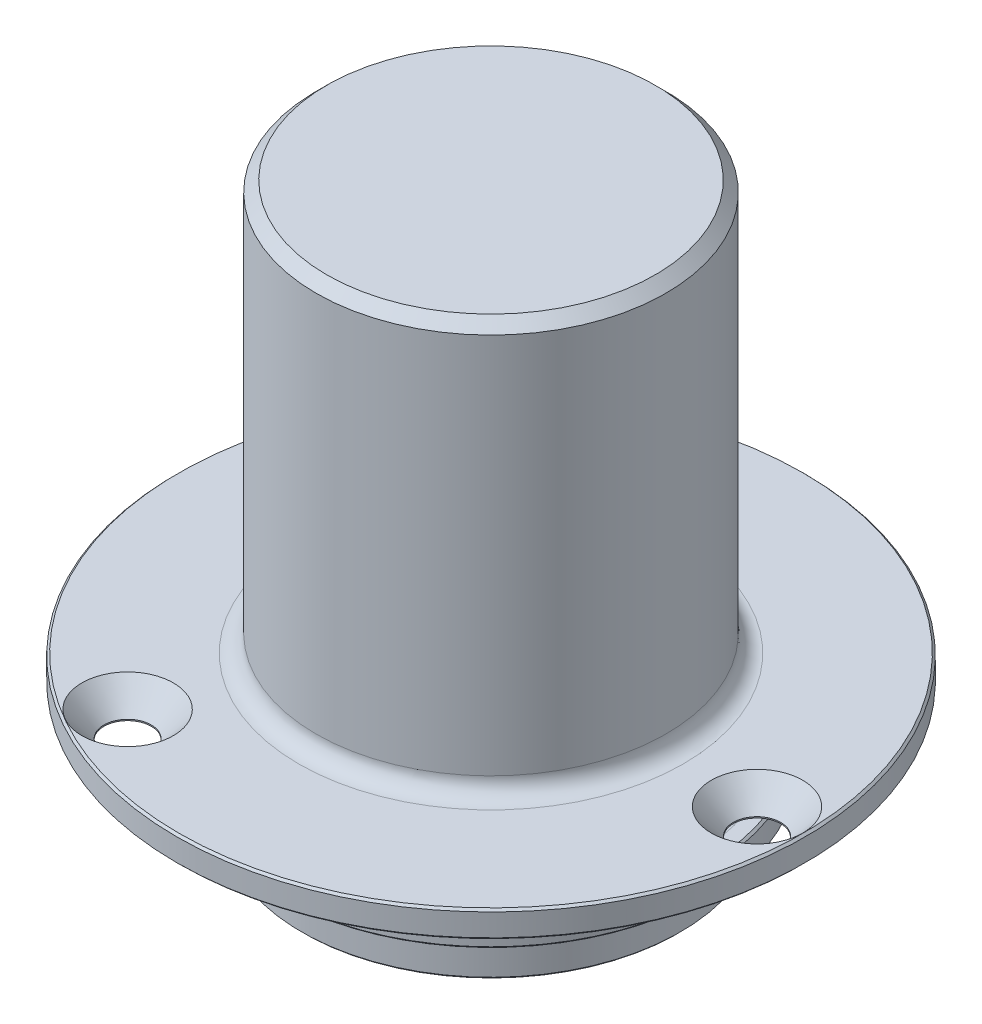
ISO-10303-21;
HEADER;
FILE_DESCRIPTION(('STEP AP214'),'2;1');
FILE_NAME('part.step','',(''),(''),'','','');
FILE_SCHEMA(('AUTOMOTIVE_DESIGN { 1 0 10303 214 1 1 1 1 }'));
ENDSEC;
DATA;
#1=APPLICATION_CONTEXT('core data for automotive mechanical design processes');
#2=APPLICATION_PROTOCOL_DEFINITION('international standard','automotive_design',2000,#1);
#3=PRODUCT_CONTEXT('',#1,'mechanical');
#4=PRODUCT('Part','Part','',(#3));
#5=PRODUCT_RELATED_PRODUCT_CATEGORY('part','',(#4));
#6=PRODUCT_DEFINITION_FORMATION('','',#4);
#7=PRODUCT_DEFINITION_CONTEXT('part definition',#1,'design');
#8=PRODUCT_DEFINITION('design','',#6,#7);
#9=PRODUCT_DEFINITION_SHAPE('','',#8);
#10=(LENGTH_UNIT() NAMED_UNIT(*) SI_UNIT(.MILLI.,.METRE.));
#11=(NAMED_UNIT(*) PLANE_ANGLE_UNIT() SI_UNIT($,.RADIAN.));
#12=(NAMED_UNIT(*) SI_UNIT($,.STERADIAN.) SOLID_ANGLE_UNIT());
#13=UNCERTAINTY_MEASURE_WITH_UNIT(LENGTH_MEASURE(1.E-05),#10,'distance_accuracy_value','');
#14=(GEOMETRIC_REPRESENTATION_CONTEXT(3) GLOBAL_UNCERTAINTY_ASSIGNED_CONTEXT((#13)) GLOBAL_UNIT_ASSIGNED_CONTEXT((#10,
#11,#12)) REPRESENTATION_CONTEXT('',''));
#15=CARTESIAN_POINT('',(0.,0.,0.));
#16=DIRECTION('',(0.,0.,1.));
#17=DIRECTION('',(1.,0.,0.));
#18=AXIS2_PLACEMENT_3D('',#15,#16,#17);
#19=CARTESIAN_POINT('',(-9.04239999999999,5.588,0.));
#20=DIRECTION('',(0.,-1.,0.));
#21=DIRECTION('',(0.,0.,-1.));
#22=AXIS2_PLACEMENT_3D('',#19,#20,#21);
#23=PLANE('',#22);
#24=CARTESIAN_POINT('',(0.,5.588,0.));
#25=DIRECTION('',(0.,-1.,0.));
#26=DIRECTION('',(0.,0.,-1.));
#27=AXIS2_PLACEMENT_3D('',#24,#25,#26);
#28=CIRCLE('',#27,9.54239999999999);
#29=CARTESIAN_POINT('',(0.,5.588,-9.54239999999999));
#30=VERTEX_POINT('',#29);
#31=EDGE_CURVE('E83',#30,#30,#28,.F.);
#32=ORIENTED_EDGE('',*,*,#31,.T.);
#33=EDGE_LOOP('',(#32));
#34=FACE_BOUND('',#33,.T.);
#35=CARTESIAN_POINT('',(0.,5.588,0.));
#36=DIRECTION('',(0.,1.,0.));
#37=DIRECTION('',(0.,0.,1.));
#38=AXIS2_PLACEMENT_3D('',#35,#36,#37);
#39=CIRCLE('',#38,10.3124);
#40=CARTESIAN_POINT('',(0.,5.588,10.3124));
#41=VERTEX_POINT('',#40);
#42=EDGE_CURVE('E80',#41,#41,#39,.T.);
#43=ORIENTED_EDGE('',*,*,#42,.F.);
#44=EDGE_LOOP('',(#43));
#45=FACE_BOUND('',#44,.T.);
#46=ADVANCED_FACE('F35',(#34,#45),#23,.T.);
#47=CARTESIAN_POINT('',(0.,93.1822736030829,0.));
#48=DIRECTION('',(0.,1.,0.));
#49=DIRECTION('',(0.,0.,1.));
#50=AXIS2_PLACEMENT_3D('',#47,#48,#49);
#51=CYLINDRICAL_SURFACE('',#50,9.04239999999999);
#52=CARTESIAN_POINT('',(0.,5.088,0.));
#53=DIRECTION('',(0.,-1.,0.));
#54=DIRECTION('',(0.,0.,-1.));
#55=AXIS2_PLACEMENT_3D('',#52,#53,#54);
#56=CIRCLE('',#55,9.04239999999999);
#57=CARTESIAN_POINT('',(0.,5.088,-9.04239999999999));
#58=VERTEX_POINT('',#57);
#59=EDGE_CURVE('E89',#58,#58,#56,.T.);
#60=ORIENTED_EDGE('',*,*,#59,.T.);
#61=EDGE_LOOP('',(#60));
#62=FACE_BOUND('',#61,.T.);
#63=CARTESIAN_POINT('',(0.,3.929,0.));
#64=DIRECTION('',(0.,1.,0.));
#65=DIRECTION('',(0.,0.,1.));
#66=AXIS2_PLACEMENT_3D('',#63,#64,#65);
#67=CIRCLE('',#66,9.04239999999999);
#68=CARTESIAN_POINT('',(0.,3.929,9.04239999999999));
#69=VERTEX_POINT('',#68);
#70=EDGE_CURVE('E86',#69,#69,#67,.T.);
#71=ORIENTED_EDGE('',*,*,#70,.T.);
#72=EDGE_LOOP('',(#71));
#73=FACE_BOUND('',#72,.T.);
#74=ADVANCED_FACE('F192',(#62,#73),#51,.T.);
#75=CARTESIAN_POINT('',(-10.3124,3.429,0.));
#76=DIRECTION('',(0.,1.,0.));
#77=DIRECTION('',(0.,0.,1.));
#78=AXIS2_PLACEMENT_3D('',#75,#76,#77);
#79=PLANE('',#78);
#80=CARTESIAN_POINT('',(0.,3.429,0.));
#81=DIRECTION('',(0.,1.,0.));
#82=DIRECTION('',(0.,0.,1.));
#83=AXIS2_PLACEMENT_3D('',#80,#81,#82);
#84=CIRCLE('',#83,10.2124);
#85=CARTESIAN_POINT('',(0.,3.429,10.2124));
#86=VERTEX_POINT('',#85);
#87=EDGE_CURVE('E122',#86,#86,#84,.T.);
#88=ORIENTED_EDGE('',*,*,#87,.T.);
#89=EDGE_LOOP('',(#88));
#90=FACE_BOUND('',#89,.T.);
#91=CARTESIAN_POINT('',(0.,3.429,0.));
#92=DIRECTION('',(0.,1.,0.));
#93=DIRECTION('',(0.,0.,1.));
#94=AXIS2_PLACEMENT_3D('',#91,#92,#93);
#95=CIRCLE('',#94,9.54239999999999);
#96=CARTESIAN_POINT('',(0.,3.429,9.54239999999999));
#97=VERTEX_POINT('',#96);
#98=EDGE_CURVE('E92',#97,#97,#95,.F.);
#99=ORIENTED_EDGE('',*,*,#98,.T.);
#100=EDGE_LOOP('',(#99));
#101=FACE_BOUND('',#100,.T.);
#102=ADVANCED_FACE('F188',(#90,#101),#79,.T.);
#103=CARTESIAN_POINT('',(0.,93.1822736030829,0.));
#104=DIRECTION('',(0.,1.,0.));
#105=DIRECTION('',(0.,0.,1.));
#106=AXIS2_PLACEMENT_3D('',#103,#104,#105);
#107=CYLINDRICAL_SURFACE('',#106,10.3124);
#108=CARTESIAN_POINT('',(0.,3.329,0.));
#109=DIRECTION('',(0.,1.,0.));
#110=DIRECTION('',(0.,0.,1.));
#111=AXIS2_PLACEMENT_3D('',#108,#109,#110);
#112=CIRCLE('',#111,10.3124);
#113=CARTESIAN_POINT('',(0.,3.329,10.3124));
#114=VERTEX_POINT('',#113);
#115=EDGE_CURVE('E128',#114,#114,#112,.F.);
#116=ORIENTED_EDGE('',*,*,#115,.T.);
#117=EDGE_LOOP('',(#116));
#118=FACE_BOUND('',#117,.T.);
#119=CARTESIAN_POINT('',(0.,2.259,0.));
#120=DIRECTION('',(0.,-1.,0.));
#121=DIRECTION('',(0.,0.,-1.));
#122=AXIS2_PLACEMENT_3D('',#119,#120,#121);
#123=CIRCLE('',#122,10.3124);
#124=CARTESIAN_POINT('',(0.,2.259,-10.3124));
#125=VERTEX_POINT('',#124);
#126=EDGE_CURVE('E125',#125,#125,#123,.F.);
#127=ORIENTED_EDGE('',*,*,#126,.T.);
#128=EDGE_LOOP('',(#127));
#129=FACE_BOUND('',#128,.T.);
#130=ADVANCED_FACE('F182',(#118,#129),#107,.T.);
#131=CARTESIAN_POINT('',(-10.3124,2.159,0.));
#132=DIRECTION('',(0.,-1.,0.));
#133=DIRECTION('',(0.,0.,-1.));
#134=AXIS2_PLACEMENT_3D('',#131,#132,#133);
#135=PLANE('',#134);
#136=CARTESIAN_POINT('',(0.,2.159,0.));
#137=DIRECTION('',(0.,-1.,0.));
#138=DIRECTION('',(0.,0.,-1.));
#139=AXIS2_PLACEMENT_3D('',#136,#137,#138);
#140=CIRCLE('',#139,10.2124);
#141=CARTESIAN_POINT('',(0.,2.159,-10.2124));
#142=VERTEX_POINT('',#141);
#143=EDGE_CURVE('E131',#142,#142,#140,.T.);
#144=ORIENTED_EDGE('',*,*,#143,.T.);
#145=EDGE_LOOP('',(#144));
#146=FACE_BOUND('',#145,.T.);
#147=CARTESIAN_POINT('',(0.,2.159,0.));
#148=DIRECTION('',(0.,-1.,0.));
#149=DIRECTION('',(0.,0.,-1.));
#150=AXIS2_PLACEMENT_3D('',#147,#148,#149);
#151=CIRCLE('',#150,9.54239999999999);
#152=CARTESIAN_POINT('',(0.,2.159,-9.54239999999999));
#153=VERTEX_POINT('',#152);
#154=EDGE_CURVE('E98',#153,#153,#151,.F.);
#155=ORIENTED_EDGE('',*,*,#154,.T.);
#156=EDGE_LOOP('',(#155));
#157=FACE_BOUND('',#156,.T.);
#158=ADVANCED_FACE('F169',(#146,#157),#135,.T.);
#159=CARTESIAN_POINT('',(0.,93.1822736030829,0.));
#160=DIRECTION('',(0.,1.,0.));
#161=DIRECTION('',(0.,0.,1.));
#162=AXIS2_PLACEMENT_3D('',#159,#160,#161);
#163=CYLINDRICAL_SURFACE('',#162,9.04239999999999);
#164=CARTESIAN_POINT('',(0.,0.100000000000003,0.));
#165=DIRECTION('',(0.,-1.,0.));
#166=DIRECTION('',(0.,0.,-1.));
#167=AXIS2_PLACEMENT_3D('',#164,#165,#166);
#168=CIRCLE('',#167,9.04239999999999);
#169=CARTESIAN_POINT('',(0.,0.100000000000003,-9.04239999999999));
#170=VERTEX_POINT('',#169);
#171=EDGE_CURVE('E134',#170,#170,#168,.F.);
#172=ORIENTED_EDGE('',*,*,#171,.T.);
#173=EDGE_LOOP('',(#172));
#174=FACE_BOUND('',#173,.T.);
#175=CARTESIAN_POINT('',(0.,1.65899999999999,0.));
#176=DIRECTION('',(0.,-1.,0.));
#177=DIRECTION('',(0.,0.,-1.));
#178=AXIS2_PLACEMENT_3D('',#175,#176,#177);
#179=CIRCLE('',#178,9.04239999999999);
#180=CARTESIAN_POINT('',(0.,1.65899999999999,-9.04239999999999));
#181=VERTEX_POINT('',#180);
#182=EDGE_CURVE('E101',#181,#181,#179,.T.);
#183=ORIENTED_EDGE('',*,*,#182,.T.);
#184=EDGE_LOOP('',(#183));
#185=FACE_BOUND('',#184,.T.);
#186=ADVANCED_FACE('F157',(#174,#185),#163,.T.);
#187=CARTESIAN_POINT('',(-7.99999999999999,0.,0.));
#188=DIRECTION('',(0.,-1.,0.));
#189=DIRECTION('',(0.,0.,-1.));
#190=AXIS2_PLACEMENT_3D('',#187,#188,#189);
#191=PLANE('',#190);
#192=CARTESIAN_POINT('',(0.,0.,0.));
#193=DIRECTION('',(0.,-1.,0.));
#194=DIRECTION('',(0.,0.,-1.));
#195=AXIS2_PLACEMENT_3D('',#192,#193,#194);
#196=CIRCLE('',#195,7.44999999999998);
#197=CARTESIAN_POINT('',(0.,0.,-7.44999999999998));
#198=VERTEX_POINT('',#197);
#199=EDGE_CURVE('E140',#198,#198,#196,.F.);
#200=ORIENTED_EDGE('',*,*,#199,.T.);
#201=EDGE_LOOP('',(#200));
#202=FACE_BOUND('',#201,.T.);
#203=CARTESIAN_POINT('',(0.,0.,0.));
#204=DIRECTION('',(0.,-1.,0.));
#205=DIRECTION('',(0.,0.,-1.));
#206=AXIS2_PLACEMENT_3D('',#203,#204,#205);
#207=CIRCLE('',#206,8.94239999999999);
#208=CARTESIAN_POINT('',(0.,0.,-8.94239999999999));
#209=VERTEX_POINT('',#208);
#210=EDGE_CURVE('E137',#209,#209,#207,.T.);
#211=ORIENTED_EDGE('',*,*,#210,.T.);
#212=EDGE_LOOP('',(#211));
#213=FACE_BOUND('',#212,.T.);
#214=ADVANCED_FACE('F154',(#202,#213),#191,.T.);
#215=CARTESIAN_POINT('',(0.,93.1822736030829,0.));
#216=DIRECTION('',(0.,1.,0.));
#217=DIRECTION('',(0.,0.,1.));
#218=AXIS2_PLACEMENT_3D('',#215,#216,#217);
#219=CYLINDRICAL_SURFACE('',#218,6.94999999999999);
#220=CARTESIAN_POINT('',(0.,0.5,0.));
#221=DIRECTION('',(0.,-1.,0.));
#222=DIRECTION('',(0.,0.,-1.));
#223=AXIS2_PLACEMENT_3D('',#220,#221,#222);
#224=CIRCLE('',#223,6.94999999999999);
#225=CARTESIAN_POINT('',(0.,0.5,-6.94999999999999));
#226=VERTEX_POINT('',#225);
#227=EDGE_CURVE('E48',#226,#226,#224,.T.);
#228=ORIENTED_EDGE('',*,*,#227,.T.);
#229=EDGE_LOOP('',(#228));
#230=FACE_BOUND('',#229,.T.);
#231=CARTESIAN_POINT('',(0.,22.86,0.));
#232=DIRECTION('',(0.,1.,0.));
#233=DIRECTION('',(0.,0.,1.));
#234=AXIS2_PLACEMENT_3D('',#231,#232,#233);
#235=CIRCLE('',#234,6.94999999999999);
#236=CARTESIAN_POINT('',(0.,22.86,6.94999999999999));
#237=VERTEX_POINT('',#236);
#238=EDGE_CURVE('E77',#237,#237,#235,.T.);
#239=ORIENTED_EDGE('',*,*,#238,.T.);
#240=EDGE_LOOP('',(#239));
#241=FACE_BOUND('',#240,.T.);
#242=ADVANCED_FACE('F145',(#230,#241),#219,.F.);
#243=CARTESIAN_POINT('',(0.,22.86,0.));
#244=DIRECTION('',(0.,1.,0.));
#245=DIRECTION('',(0.,0.,1.));
#246=AXIS2_PLACEMENT_3D('',#243,#244,#245);
#247=TOROIDAL_SURFACE('',#246,5.67999999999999,1.27);
#248=CARTESIAN_POINT('',(0.,24.13,0.));
#249=DIRECTION('',(0.,1.,0.));
#250=DIRECTION('',(0.,0.,1.));
#251=AXIS2_PLACEMENT_3D('',#248,#249,#250);
#252=CIRCLE('',#251,5.67999999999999);
#253=CARTESIAN_POINT('',(0.,24.13,5.67999999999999));
#254=VERTEX_POINT('',#253);
#255=EDGE_CURVE('E54',#254,#254,#252,.T.);
#256=ORIENTED_EDGE('',*,*,#255,.T.);
#257=EDGE_LOOP('',(#256));
#258=FACE_BOUND('',#257,.T.);
#259=ORIENTED_EDGE('',*,*,#238,.F.);
#260=EDGE_LOOP('',(#259));
#261=FACE_BOUND('',#260,.T.);
#262=ADVANCED_FACE('F431',(#258,#261),#247,.F.);
#263=CARTESIAN_POINT('',(0.,24.13,0.));
#264=DIRECTION('',(0.,-1.,0.));
#265=DIRECTION('',(0.,0.,-1.));
#266=AXIS2_PLACEMENT_3D('',#263,#264,#265);
#267=PLANE('',#266);
#268=ORIENTED_EDGE('',*,*,#255,.F.);
#269=EDGE_LOOP('',(#268));
#270=FACE_BOUND('',#269,.T.);
#271=ADVANCED_FACE('F425',(#270),#267,.T.);
#272=CARTESIAN_POINT('',(-8.34999999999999,26.67,0.));
#273=DIRECTION('',(0.,1.,0.));
#274=DIRECTION('',(0.,0.,1.));
#275=AXIS2_PLACEMENT_3D('',#272,#273,#274);
#276=PLANE('',#275);
#277=CARTESIAN_POINT('',(0.,26.67,0.));
#278=DIRECTION('',(0.,1.,0.));
#279=DIRECTION('',(0.,0.,1.));
#280=AXIS2_PLACEMENT_3D('',#277,#278,#279);
#281=CIRCLE('',#280,7.842);
#282=CARTESIAN_POINT('',(0.,26.67,7.842));
#283=VERTEX_POINT('',#282);
#284=EDGE_CURVE('E104',#283,#283,#281,.T.);
#285=ORIENTED_EDGE('',*,*,#284,.T.);
#286=EDGE_LOOP('',(#285));
#287=FACE_BOUND('',#286,.T.);
#288=ADVANCED_FACE('F430',(#287),#276,.T.);
#289=CARTESIAN_POINT('',(0.,93.1822736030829,0.));
#290=DIRECTION('',(0.,1.,0.));
#291=DIRECTION('',(0.,0.,1.));
#292=AXIS2_PLACEMENT_3D('',#289,#290,#291);
#293=CYLINDRICAL_SURFACE('',#292,8.34999999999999);
#294=CARTESIAN_POINT('',(0.,7.9375,0.));
#295=DIRECTION('',(0.,1.,0.));
#296=DIRECTION('',(0.,0.,1.));
#297=AXIS2_PLACEMENT_3D('',#294,#295,#296);
#298=CIRCLE('',#297,8.34999999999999);
#299=CARTESIAN_POINT('',(0.,7.9375,8.34999999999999));
#300=VERTEX_POINT('',#299);
#301=EDGE_CURVE('E43',#300,#300,#298,.T.);
#302=ORIENTED_EDGE('',*,*,#301,.T.);
#303=EDGE_LOOP('',(#302));
#304=FACE_BOUND('',#303,.T.);
#305=CARTESIAN_POINT('',(0.,26.162,0.));
#306=DIRECTION('',(0.,1.,0.));
#307=DIRECTION('',(0.,0.,1.));
#308=AXIS2_PLACEMENT_3D('',#305,#306,#307);
#309=CIRCLE('',#308,8.34999999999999);
#310=CARTESIAN_POINT('',(0.,26.162,8.34999999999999));
#311=VERTEX_POINT('',#310);
#312=EDGE_CURVE('E107',#311,#311,#309,.F.);
#313=ORIENTED_EDGE('',*,*,#312,.T.);
#314=EDGE_LOOP('',(#313));
#315=FACE_BOUND('',#314,.T.);
#316=ADVANCED_FACE('F341',(#304,#315),#293,.T.);
#317=CARTESIAN_POINT('',(-9.52499999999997,7.112,0.));
#318=DIRECTION('',(0.,1.,0.));
#319=DIRECTION('',(0.,0.,1.));
#320=AXIS2_PLACEMENT_3D('',#317,#318,#319);
#321=PLANE('',#320);
#322=CARTESIAN_POINT('',(-6.3499999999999,7.112,10.9985226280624));
#323=DIRECTION('',(0.,1.,0.));
#324=DIRECTION('',(0.,0.,1.));
#325=AXIS2_PLACEMENT_3D('',#322,#323,#324);
#326=CIRCLE('',#325,2.1844);
#327=CARTESIAN_POINT('',(-6.3499999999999,7.112,13.1829226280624));
#328=VERTEX_POINT('',#327);
#329=EDGE_CURVE('E533',#328,#328,#326,.T.);
#330=ORIENTED_EDGE('',*,*,#329,.F.);
#331=EDGE_LOOP('',(#330));
#332=FACE_BOUND('',#331,.T.);
#333=CARTESIAN_POINT('',(-6.35000000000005,7.112,-10.9985226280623));
#334=DIRECTION('',(0.,1.,0.));
#335=DIRECTION('',(0.,0.,1.));
#336=AXIS2_PLACEMENT_3D('',#333,#334,#335);
#337=CIRCLE('',#336,2.1844);
#338=CARTESIAN_POINT('',(-6.35000000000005,7.112,-8.81412262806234));
#339=VERTEX_POINT('',#338);
#340=EDGE_CURVE('E65',#339,#339,#337,.T.);
#341=ORIENTED_EDGE('',*,*,#340,.F.);
#342=EDGE_LOOP('',(#341));
#343=FACE_BOUND('',#342,.T.);
#344=CARTESIAN_POINT('',(12.7,7.112,0.));
#345=DIRECTION('',(0.,1.,0.));
#346=DIRECTION('',(0.,0.,1.));
#347=AXIS2_PLACEMENT_3D('',#344,#345,#346);
#348=CIRCLE('',#347,2.1844);
#349=CARTESIAN_POINT('',(12.7,7.112,2.1844));
#350=VERTEX_POINT('',#349);
#351=EDGE_CURVE('E58',#350,#350,#348,.T.);
#352=ORIENTED_EDGE('',*,*,#351,.F.);
#353=EDGE_LOOP('',(#352));
#354=FACE_BOUND('',#353,.T.);
#355=CARTESIAN_POINT('',(0.,7.112,0.));
#356=DIRECTION('',(0.,1.,0.));
#357=DIRECTION('',(0.,0.,1.));
#358=AXIS2_PLACEMENT_3D('',#355,#356,#357);
#359=CIRCLE('',#358,9.17549999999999);
#360=CARTESIAN_POINT('',(0.,7.112,9.17549999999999));
#361=VERTEX_POINT('',#360);
#362=EDGE_CURVE('E10',#361,#361,#359,.F.);
#363=ORIENTED_EDGE('',*,*,#362,.T.);
#364=EDGE_LOOP('',(#363));
#365=FACE_BOUND('',#364,.T.);
#366=CARTESIAN_POINT('',(0.,7.112,0.));
#367=DIRECTION('',(0.,1.,0.));
#368=DIRECTION('',(0.,0.,1.));
#369=AXIS2_PLACEMENT_3D('',#366,#367,#368);
#370=CIRCLE('',#369,14.9);
#371=CARTESIAN_POINT('',(0.,7.112,14.9));
#372=VERTEX_POINT('',#371);
#373=EDGE_CURVE('E110',#372,#372,#370,.T.);
#374=ORIENTED_EDGE('',*,*,#373,.T.);
#375=EDGE_LOOP('',(#374));
#376=FACE_BOUND('',#375,.T.);
#377=ADVANCED_FACE('F337',(#332,#343,#354,#365,#376),#321,.T.);
#378=CARTESIAN_POINT('',(0.,93.1822736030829,0.));
#379=DIRECTION('',(0.,1.,0.));
#380=DIRECTION('',(0.,0.,1.));
#381=AXIS2_PLACEMENT_3D('',#378,#379,#380);
#382=CYLINDRICAL_SURFACE('',#381,15.);
#383=CARTESIAN_POINT('',(0.,7.01199999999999,0.));
#384=DIRECTION('',(0.,1.,0.));
#385=DIRECTION('',(0.,0.,1.));
#386=AXIS2_PLACEMENT_3D('',#383,#384,#385);
#387=CIRCLE('',#386,15.);
#388=CARTESIAN_POINT('',(0.,7.01199999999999,15.));
#389=VERTEX_POINT('',#388);
#390=EDGE_CURVE('E116',#389,#389,#387,.F.);
#391=ORIENTED_EDGE('',*,*,#390,.T.);
#392=EDGE_LOOP('',(#391));
#393=FACE_BOUND('',#392,.T.);
#394=CARTESIAN_POINT('',(0.,5.942,0.));
#395=DIRECTION('',(0.,-1.,0.));
#396=DIRECTION('',(0.,0.,-1.));
#397=AXIS2_PLACEMENT_3D('',#394,#395,#396);
#398=CIRCLE('',#397,15.);
#399=CARTESIAN_POINT('',(0.,5.942,-15.));
#400=VERTEX_POINT('',#399);
#401=EDGE_CURVE('E113',#400,#400,#398,.F.);
#402=ORIENTED_EDGE('',*,*,#401,.T.);
#403=EDGE_LOOP('',(#402));
#404=FACE_BOUND('',#403,.T.);
#405=ADVANCED_FACE('F328',(#393,#404),#382,.T.);
#406=CARTESIAN_POINT('',(-15.,5.842,0.));
#407=DIRECTION('',(0.,-1.,0.));
#408=DIRECTION('',(0.,0.,-1.));
#409=AXIS2_PLACEMENT_3D('',#406,#407,#408);
#410=PLANE('',#409);
#411=CARTESIAN_POINT('',(-6.3499999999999,5.842,10.9985226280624));
#412=DIRECTION('',(0.,-1.,0.));
#413=DIRECTION('',(0.,0.,-1.));
#414=AXIS2_PLACEMENT_3D('',#411,#412,#413);
#415=CIRCLE('',#414,1.1303);
#416=CARTESIAN_POINT('',(-6.3499999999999,5.842,9.86822262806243));
#417=VERTEX_POINT('',#416);
#418=EDGE_CURVE('E39',#417,#417,#415,.T.);
#419=ORIENTED_EDGE('',*,*,#418,.F.);
#420=EDGE_LOOP('',(#419));
#421=FACE_BOUND('',#420,.T.);
#422=CARTESIAN_POINT('',(-6.35000000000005,5.842,-10.9985226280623));
#423=DIRECTION('',(0.,-1.,0.));
#424=DIRECTION('',(0.,0.,-1.));
#425=AXIS2_PLACEMENT_3D('',#422,#423,#424);
#426=CIRCLE('',#425,1.1303);
#427=CARTESIAN_POINT('',(-6.35000000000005,5.842,-12.1288226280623));
#428=VERTEX_POINT('',#427);
#429=EDGE_CURVE('E56',#428,#428,#426,.T.);
#430=ORIENTED_EDGE('',*,*,#429,.F.);
#431=EDGE_LOOP('',(#430));
#432=FACE_BOUND('',#431,.T.);
#433=CARTESIAN_POINT('',(12.7,5.842,0.));
#434=DIRECTION('',(0.,-1.,0.));
#435=DIRECTION('',(0.,0.,-1.));
#436=AXIS2_PLACEMENT_3D('',#433,#434,#435);
#437=CIRCLE('',#436,1.1303);
#438=CARTESIAN_POINT('',(12.7,5.842,-1.1303));
#439=VERTEX_POINT('',#438);
#440=EDGE_CURVE('E52',#439,#439,#437,.T.);
#441=ORIENTED_EDGE('',*,*,#440,.F.);
#442=EDGE_LOOP('',(#441));
#443=FACE_BOUND('',#442,.T.);
#444=CARTESIAN_POINT('',(0.,5.842,0.));
#445=DIRECTION('',(0.,-1.,0.));
#446=DIRECTION('',(0.,0.,-1.));
#447=AXIS2_PLACEMENT_3D('',#444,#445,#446);
#448=CIRCLE('',#447,14.9);
#449=CARTESIAN_POINT('',(0.,5.842,-14.9));
#450=VERTEX_POINT('',#449);
#451=EDGE_CURVE('E119',#450,#450,#448,.T.);
#452=ORIENTED_EDGE('',*,*,#451,.T.);
#453=EDGE_LOOP('',(#452));
#454=FACE_BOUND('',#453,.T.);
#455=CARTESIAN_POINT('',(0.,5.842,0.));
#456=DIRECTION('',(0.,-1.,0.));
#457=DIRECTION('',(0.,0.,-1.));
#458=AXIS2_PLACEMENT_3D('',#455,#456,#457);
#459=CIRCLE('',#458,10.7476975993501);
#460=CARTESIAN_POINT('',(0.,5.842,-10.7476975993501));
#461=VERTEX_POINT('',#460);
#462=EDGE_CURVE('E95',#461,#461,#459,.F.);
#463=ORIENTED_EDGE('',*,*,#462,.T.);
#464=EDGE_LOOP('',(#463));
#465=FACE_BOUND('',#464,.T.);
#466=ADVANCED_FACE('F207',(#421,#432,#443,#454,#465),#410,.T.);
#467=CARTESIAN_POINT('',(0.,5.088,0.));
#468=DIRECTION('',(0.,-1.,0.));
#469=DIRECTION('',(0.,0.,-1.));
#470=AXIS2_PLACEMENT_3D('',#467,#468,#469);
#471=TOROIDAL_SURFACE('',#470,9.54239999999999,0.5);
#472=ORIENTED_EDGE('',*,*,#59,.F.);
#473=EDGE_LOOP('',(#472));
#474=FACE_BOUND('',#473,.T.);
#475=ORIENTED_EDGE('',*,*,#31,.F.);
#476=EDGE_LOOP('',(#475));
#477=FACE_BOUND('',#476,.T.);
#478=ADVANCED_FACE('F203',(#474,#477),#471,.F.);
#479=CARTESIAN_POINT('',(0.,3.929,0.));
#480=DIRECTION('',(0.,1.,0.));
#481=DIRECTION('',(0.,0.,1.));
#482=AXIS2_PLACEMENT_3D('',#479,#480,#481);
#483=TOROIDAL_SURFACE('',#482,9.54239999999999,0.5);
#484=ORIENTED_EDGE('',*,*,#98,.F.);
#485=EDGE_LOOP('',(#484));
#486=FACE_BOUND('',#485,.T.);
#487=ORIENTED_EDGE('',*,*,#70,.F.);
#488=EDGE_LOOP('',(#487));
#489=FACE_BOUND('',#488,.T.);
#490=ADVANCED_FACE('F206',(#486,#489),#483,.F.);
#491=CARTESIAN_POINT('',(0.,5.342,0.));
#492=DIRECTION('',(0.,-1.,0.));
#493=DIRECTION('',(0.,0.,-1.));
#494=AXIS2_PLACEMENT_3D('',#491,#492,#493);
#495=TOROIDAL_SURFACE('',#494,10.7476975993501,0.5);
#496=ORIENTED_EDGE('',*,*,#42,.T.);
#497=EDGE_LOOP('',(#496));
#498=FACE_BOUND('',#497,.T.);
#499=ORIENTED_EDGE('',*,*,#462,.F.);
#500=EDGE_LOOP('',(#499));
#501=FACE_BOUND('',#500,.T.);
#502=ADVANCED_FACE('F177',(#498,#501),#495,.F.);
#503=CARTESIAN_POINT('',(0.,1.65899999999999,0.));
#504=DIRECTION('',(0.,-1.,0.));
#505=DIRECTION('',(0.,0.,-1.));
#506=AXIS2_PLACEMENT_3D('',#503,#504,#505);
#507=TOROIDAL_SURFACE('',#506,9.54239999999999,0.5);
#508=ORIENTED_EDGE('',*,*,#182,.F.);
#509=EDGE_LOOP('',(#508));
#510=FACE_BOUND('',#509,.T.);
#511=ORIENTED_EDGE('',*,*,#154,.F.);
#512=EDGE_LOOP('',(#511));
#513=FACE_BOUND('',#512,.T.);
#514=ADVANCED_FACE('F173',(#510,#513),#507,.F.);
#515=CARTESIAN_POINT('',(0.,26.67,0.));
#516=DIRECTION('',(0.,-1.,0.));
#517=DIRECTION('',(0.,0.,-1.));
#518=AXIS2_PLACEMENT_3D('',#515,#516,#517);
#519=CONICAL_SURFACE('',#518,7.842,0.785398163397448);
#520=ORIENTED_EDGE('',*,*,#312,.F.);
#521=EDGE_LOOP('',(#520));
#522=FACE_BOUND('',#521,.T.);
#523=ORIENTED_EDGE('',*,*,#284,.F.);
#524=EDGE_LOOP('',(#523));
#525=FACE_BOUND('',#524,.T.);
#526=ADVANCED_FACE('F176',(#522,#525),#519,.T.);
#527=CARTESIAN_POINT('',(0.,7.11200000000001,0.));
#528=DIRECTION('',(0.,-1.,0.));
#529=DIRECTION('',(0.,0.,-1.));
#530=AXIS2_PLACEMENT_3D('',#527,#528,#529);
#531=CONICAL_SURFACE('',#530,14.9,0.785398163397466);
#532=ORIENTED_EDGE('',*,*,#390,.F.);
#533=EDGE_LOOP('',(#532));
#534=FACE_BOUND('',#533,.T.);
#535=ORIENTED_EDGE('',*,*,#373,.F.);
#536=EDGE_LOOP('',(#535));
#537=FACE_BOUND('',#536,.T.);
#538=ADVANCED_FACE('F217',(#534,#537),#531,.T.);
#539=CARTESIAN_POINT('',(0.,5.942,0.));
#540=DIRECTION('',(0.,1.,0.));
#541=DIRECTION('',(0.,0.,1.));
#542=AXIS2_PLACEMENT_3D('',#539,#540,#541);
#543=CONICAL_SURFACE('',#542,15.,0.785398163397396);
#544=ORIENTED_EDGE('',*,*,#451,.F.);
#545=EDGE_LOOP('',(#544));
#546=FACE_BOUND('',#545,.T.);
#547=ORIENTED_EDGE('',*,*,#401,.F.);
#548=EDGE_LOOP('',(#547));
#549=FACE_BOUND('',#548,.T.);
#550=ADVANCED_FACE('F221',(#546,#549),#543,.T.);
#551=CARTESIAN_POINT('',(0.,3.429,0.));
#552=DIRECTION('',(0.,-1.,0.));
#553=DIRECTION('',(0.,0.,-1.));
#554=AXIS2_PLACEMENT_3D('',#551,#552,#553);
#555=CONICAL_SURFACE('',#554,10.2124,0.78539816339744);
#556=ORIENTED_EDGE('',*,*,#115,.F.);
#557=EDGE_LOOP('',(#556));
#558=FACE_BOUND('',#557,.T.);
#559=ORIENTED_EDGE('',*,*,#87,.F.);
#560=EDGE_LOOP('',(#559));
#561=FACE_BOUND('',#560,.T.);
#562=ADVANCED_FACE('F225',(#558,#561),#555,.T.);
#563=CARTESIAN_POINT('',(0.,2.259,0.));
#564=DIRECTION('',(0.,1.,0.));
#565=DIRECTION('',(0.,0.,1.));
#566=AXIS2_PLACEMENT_3D('',#563,#564,#565);
#567=CONICAL_SURFACE('',#566,10.3124,0.78539816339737);
#568=ORIENTED_EDGE('',*,*,#143,.F.);
#569=EDGE_LOOP('',(#568));
#570=FACE_BOUND('',#569,.T.);
#571=ORIENTED_EDGE('',*,*,#126,.F.);
#572=EDGE_LOOP('',(#571));
#573=FACE_BOUND('',#572,.T.);
#574=ADVANCED_FACE('F163',(#570,#573),#567,.T.);
#575=CARTESIAN_POINT('',(0.,0.100000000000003,0.));
#576=DIRECTION('',(0.,1.,0.));
#577=DIRECTION('',(0.,0.,1.));
#578=AXIS2_PLACEMENT_3D('',#575,#576,#577);
#579=CONICAL_SURFACE('',#578,9.04239999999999,0.785398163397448);
#580=ORIENTED_EDGE('',*,*,#210,.F.);
#581=EDGE_LOOP('',(#580));
#582=FACE_BOUND('',#581,.T.);
#583=ORIENTED_EDGE('',*,*,#171,.F.);
#584=EDGE_LOOP('',(#583));
#585=FACE_BOUND('',#584,.T.);
#586=ADVANCED_FACE('F151',(#582,#585),#579,.T.);
#587=CARTESIAN_POINT('',(0.,0.,0.));
#588=DIRECTION('',(0.,-1.,0.));
#589=DIRECTION('',(0.,0.,-1.));
#590=AXIS2_PLACEMENT_3D('',#587,#588,#589);
#591=CONICAL_SURFACE('',#590,7.44999999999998,0.785398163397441);
#592=ORIENTED_EDGE('',*,*,#227,.F.);
#593=EDGE_LOOP('',(#592));
#594=FACE_BOUND('',#593,.T.);
#595=ORIENTED_EDGE('',*,*,#199,.F.);
#596=EDGE_LOOP('',(#595));
#597=FACE_BOUND('',#596,.T.);
#598=ADVANCED_FACE('F148',(#594,#597),#591,.F.);
#599=CARTESIAN_POINT('',(0.,7.9375,0.));
#600=DIRECTION('',(0.,1.,0.));
#601=DIRECTION('',(0.,0.,1.));
#602=AXIS2_PLACEMENT_3D('',#599,#600,#601);
#603=TOROIDAL_SURFACE('',#602,9.17549999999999,0.8255);
#604=ORIENTED_EDGE('',*,*,#362,.F.);
#605=EDGE_LOOP('',(#604));
#606=FACE_BOUND('',#605,.T.);
#607=ORIENTED_EDGE('',*,*,#301,.F.);
#608=EDGE_LOOP('',(#607));
#609=FACE_BOUND('',#608,.T.);
#610=ADVANCED_FACE('F37',(#606,#609),#603,.F.);
#611=CARTESIAN_POINT('',(12.7,7.112,0.));
#612=DIRECTION('',(0.,1.,0.));
#613=DIRECTION('',(0.,0.,1.));
#614=AXIS2_PLACEMENT_3D('',#611,#612,#613);
#615=CYLINDRICAL_SURFACE('',#614,1.1303);
#616=ORIENTED_EDGE('',*,*,#440,.T.);
#617=EDGE_LOOP('',(#616));
#618=FACE_BOUND('',#617,.T.);
#619=CARTESIAN_POINT('',(12.7,5.89939666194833,0.));
#620=DIRECTION('',(0.,1.,0.));
#621=DIRECTION('',(0.,0.,1.));
#622=AXIS2_PLACEMENT_3D('',#619,#620,#621);
#623=CIRCLE('',#622,1.1303);
#624=CARTESIAN_POINT('',(12.7,5.89939666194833,1.1303));
#625=VERTEX_POINT('',#624);
#626=EDGE_CURVE('E55',#625,#625,#623,.T.);
#627=ORIENTED_EDGE('',*,*,#626,.T.);
#628=EDGE_LOOP('',(#627));
#629=FACE_BOUND('',#628,.T.);
#630=ADVANCED_FACE('F257',(#618,#629),#615,.F.);
#631=CARTESIAN_POINT('',(12.7,7.112,0.));
#632=DIRECTION('',(0.,1.,0.));
#633=DIRECTION('',(0.,0.,1.));
#634=AXIS2_PLACEMENT_3D('',#631,#632,#633);
#635=CONICAL_SURFACE('',#634,2.1844,0.715584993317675);
#636=ORIENTED_EDGE('',*,*,#626,.F.);
#637=EDGE_LOOP('',(#636));
#638=FACE_BOUND('',#637,.T.);
#639=ORIENTED_EDGE('',*,*,#351,.T.);
#640=EDGE_LOOP('',(#639));
#641=FACE_BOUND('',#640,.T.);
#642=ADVANCED_FACE('F264',(#638,#641),#635,.F.);
#643=CARTESIAN_POINT('',(-6.35000000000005,7.112,-10.9985226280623));
#644=DIRECTION('',(0.,1.,0.));
#645=DIRECTION('',(0.,0.,1.));
#646=AXIS2_PLACEMENT_3D('',#643,#644,#645);
#647=CYLINDRICAL_SURFACE('',#646,1.1303);
#648=ORIENTED_EDGE('',*,*,#429,.T.);
#649=EDGE_LOOP('',(#648));
#650=FACE_BOUND('',#649,.T.);
#651=CARTESIAN_POINT('',(-6.35000000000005,5.89939666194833,-10.9985226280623));
#652=DIRECTION('',(0.,1.,0.));
#653=DIRECTION('',(0.,0.,1.));
#654=AXIS2_PLACEMENT_3D('',#651,#652,#653);
#655=CIRCLE('',#654,1.1303);
#656=CARTESIAN_POINT('',(-6.35000000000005,5.89939666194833,-9.86822262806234));
#657=VERTEX_POINT('',#656);
#658=EDGE_CURVE('E59',#657,#657,#655,.T.);
#659=ORIENTED_EDGE('',*,*,#658,.T.);
#660=EDGE_LOOP('',(#659));
#661=FACE_BOUND('',#660,.T.);
#662=ADVANCED_FACE('F272',(#650,#661),#647,.F.);
#663=CARTESIAN_POINT('',(-6.35000000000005,7.112,-10.9985226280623));
#664=DIRECTION('',(0.,1.,0.));
#665=DIRECTION('',(0.,0.,1.));
#666=AXIS2_PLACEMENT_3D('',#663,#664,#665);
#667=CONICAL_SURFACE('',#666,2.1844,0.715584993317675);
#668=ORIENTED_EDGE('',*,*,#658,.F.);
#669=EDGE_LOOP('',(#668));
#670=FACE_BOUND('',#669,.T.);
#671=ORIENTED_EDGE('',*,*,#340,.T.);
#672=EDGE_LOOP('',(#671));
#673=FACE_BOUND('',#672,.T.);
#674=ADVANCED_FACE('F281',(#670,#673),#667,.F.);
#675=CARTESIAN_POINT('',(-6.3499999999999,7.112,10.9985226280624));
#676=DIRECTION('',(0.,1.,0.));
#677=DIRECTION('',(0.,0.,1.));
#678=AXIS2_PLACEMENT_3D('',#675,#676,#677);
#679=CYLINDRICAL_SURFACE('',#678,1.1303);
#680=ORIENTED_EDGE('',*,*,#418,.T.);
#681=EDGE_LOOP('',(#680));
#682=FACE_BOUND('',#681,.T.);
#683=CARTESIAN_POINT('',(-6.3499999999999,5.89939666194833,10.9985226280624));
#684=DIRECTION('',(0.,1.,0.));
#685=DIRECTION('',(0.,0.,1.));
#686=AXIS2_PLACEMENT_3D('',#683,#684,#685);
#687=CIRCLE('',#686,1.1303);
#688=CARTESIAN_POINT('',(-6.3499999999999,5.89939666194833,12.1288226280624));
#689=VERTEX_POINT('',#688);
#690=EDGE_CURVE('E540',#689,#689,#687,.T.);
#691=ORIENTED_EDGE('',*,*,#690,.T.);
#692=EDGE_LOOP('',(#691));
#693=FACE_BOUND('',#692,.T.);
#694=ADVANCED_FACE('F289',(#682,#693),#679,.F.);
#695=CARTESIAN_POINT('',(-6.3499999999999,7.112,10.9985226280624));
#696=DIRECTION('',(0.,1.,0.));
#697=DIRECTION('',(0.,0.,1.));
#698=AXIS2_PLACEMENT_3D('',#695,#696,#697);
#699=CONICAL_SURFACE('',#698,2.1844,0.715584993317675);
#700=ORIENTED_EDGE('',*,*,#690,.F.);
#701=EDGE_LOOP('',(#700));
#702=FACE_BOUND('',#701,.T.);
#703=ORIENTED_EDGE('',*,*,#329,.T.);
#704=EDGE_LOOP('',(#703));
#705=FACE_BOUND('',#704,.T.);
#706=ADVANCED_FACE('F298',(#702,#705),#699,.F.);
#707=CLOSED_SHELL('',(#46,#74,#102,#130,#158,#186,#214,#242,#262,#271,#288,#316,#377,#405,#466,
#478,#490,#502,#514,#526,#538,#550,#562,#574,#586,#598,#610,#630,#642,#662,#674,#694,#706));
#708=MANIFOLD_SOLID_BREP('B2',#707);
#709=ADVANCED_BREP_SHAPE_REPRESENTATION('',(#18,#708),#14);
#710=SHAPE_DEFINITION_REPRESENTATION(#9,#709);
ENDSEC;
END-ISO-10303-21;
